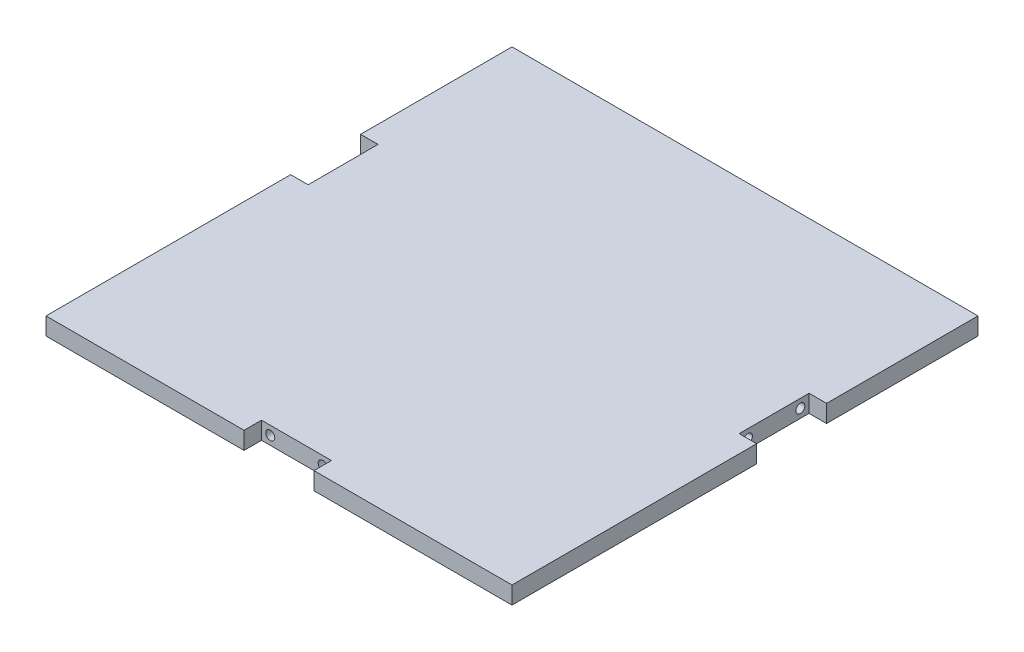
from build123d import *

# Parameters (mm, degrees)
SKETCH1_W                        = 254
SKETCH1_H                        = 254
BOSS_EXTRUDE1_DEPTH              = 9.525
SKETCH7_W                        = 9.525
SKETCH7_H                        = 38.1
SKETCH7_W_2                      = 38.1
SKETCH7_H_2                      = 9.525
CUT_EXTRUDE4_DEPTH               = 180.857514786
F_10_0_1935_DIAMETER_HOLE1_D     = 4.9149
F_10_0_1935_DIAMETER_HOLE1_DEPTH = 12.7
F_10_0_1935_DIAMETER_HOLE1_TIP   = 1.476584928
F_10_0_1935_DIAMETER_HOLE2_D     = 4.9149
F_10_0_1935_DIAMETER_HOLE2_DEPTH = 12.7
F_10_0_1935_DIAMETER_HOLE2_TIP   = 1.476584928
F_10_0_1935_DIAMETER_HOLE3_D     = 4.9149
F_10_0_1935_DIAMETER_HOLE3_DEPTH = 12.7
F_10_0_1935_DIAMETER_HOLE3_TIP   = 1.476584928


with BuildPart() as part:
    # Sketch1 → Boss-Extrude1 (new body)
    with BuildSketch(Plane(origin=(0, 0, 0), x_dir=(1, 0, 0), z_dir=(0, 1, 0))):
        Rectangle(SKETCH1_W, SKETCH1_H)
    extrude(amount=BOSS_EXTRUDE1_DEPTH)

    # Sketch7 → Cut-Extrude4 (cut, through all)
    with BuildSketch(Plane(origin=(0, 9.525, 0), x_dir=(1, 0, 0), z_dir=(0, 1, 0))):
        with Locations((-122.2375, 25.4)):
            Rectangle(SKETCH7_W, SKETCH7_H)
        with Locations((122.2375, 25.4)):
            Rectangle(SKETCH7_W, SKETCH7_H)
        with Locations((0, -122.2375)):
            Rectangle(SKETCH7_W_2, SKETCH7_H_2)
    extrude(amount=-CUT_EXTRUDE4_DEPTH, mode=Mode.SUBTRACT)

    # 10 _0.1935_ Diameter Hole1
    with Locations(Plane(origin=(117.475, 0, 0), x_dir=(0, 0, -1), z_dir=(1, 0, 0))):
        with Locations((11.1125, 4.7625), (39.6875, 4.7625)):
            Hole(F_10_0_1935_DIAMETER_HOLE1_D / 2, depth=F_10_0_1935_DIAMETER_HOLE1_DEPTH)
            with Locations((0, 0, -(F_10_0_1935_DIAMETER_HOLE1_DEPTH + F_10_0_1935_DIAMETER_HOLE1_TIP / 2))):  # 118° drill point
                Cone(0, F_10_0_1935_DIAMETER_HOLE1_D / 2, F_10_0_1935_DIAMETER_HOLE1_TIP, mode=Mode.SUBTRACT)

    # 10 _0.1935_ Diameter Hole2
    with Locations(Plane.XY.offset(117.475)):
        with Locations((-14.2875, 4.7625), (14.2875, 4.7625)):
            Hole(F_10_0_1935_DIAMETER_HOLE2_D / 2, depth=F_10_0_1935_DIAMETER_HOLE2_DEPTH)
            with Locations((0, 0, -(F_10_0_1935_DIAMETER_HOLE2_DEPTH + F_10_0_1935_DIAMETER_HOLE2_TIP / 2))):  # 118° drill point
                Cone(0, F_10_0_1935_DIAMETER_HOLE2_D / 2, F_10_0_1935_DIAMETER_HOLE2_TIP, mode=Mode.SUBTRACT)

    # 10 _0.1935_ Diameter Hole3
    with Locations(Plane.ZY.offset(117.475)):
        with Locations((-39.6875, 4.7625), (-11.1125, 4.7625)):
            Hole(F_10_0_1935_DIAMETER_HOLE3_D / 2, depth=F_10_0_1935_DIAMETER_HOLE3_DEPTH)
            with Locations((0, 0, -(F_10_0_1935_DIAMETER_HOLE3_DEPTH + F_10_0_1935_DIAMETER_HOLE3_TIP / 2))):  # 118° drill point
                Cone(0, F_10_0_1935_DIAMETER_HOLE3_D / 2, F_10_0_1935_DIAMETER_HOLE3_TIP, mode=Mode.SUBTRACT)


solid = part.part
